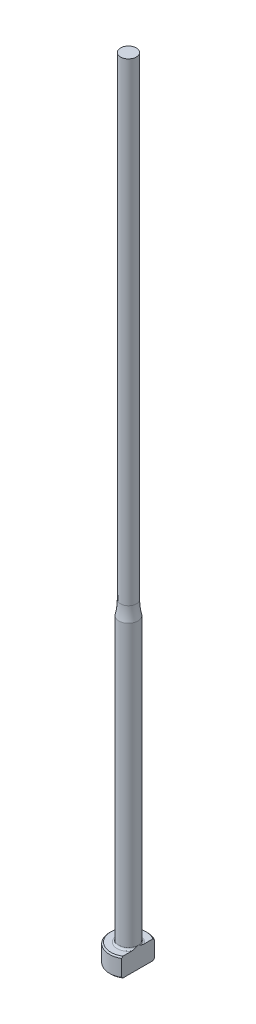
from build123d import *
from build123d.topology import SkipClean

# Parameters (mm, degrees)
CHAMFER1_SIZE = 0.2
FILLET1_R     = 0.3
KEY_DEPTH     = 126.071979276


with BuildPart() as part:
    # Sketch1 → Revolve1 (revolve)
    with BuildSketch(Plane.XY, mode=Mode.PRIVATE) as revolve1_sk:
        with BuildLine():
            Line((0, 0), (-3, 0))
            Line((-3, 0), (-3, 3))
            Line((-3, 3), (-1.5, 3))
            Line((-1.5, 3), (-1.5, 47.777951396))
            ThreePointArc((-1.5, 47.777951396), (-1.312696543, 48.881966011), (-1.25, 50))
            Line((-1.25, 50), (-1.25, 125))
            Line((-1.25, 125), (0, 125))
            Line((0, 125), (0, 0))
        make_face()
    revolve(revolve1_sk.sketch.rotate(Axis((0, 259.958771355, 0), (0, -1, 0)), 270), axis=Axis((0, 259.958771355, 0), (0, -1, 0)))

    # Chamfer1
    chamfer1_edges = [part.edges().sort_by_distance(p)[0] for p in [
        (0, 0, -3),
        (0, 3, -3),
    ]]
    chamfer(chamfer1_edges, length=CHAMFER1_SIZE)

    # Fillet1
    fillet1_edges = [part.edges().sort_by_distance(p)[0] for p in [
        (0, 3, -1.5),
    ]]
    fillet(fillet1_edges, radius=FILLET1_R)

    # Sketch2 → KEY (cut, through all)
    with SkipClean():  # the faces are left unmerged after this step: merging them gives an invalid solid
        with BuildSketch(Plane(origin=(0, 0, 0), x_dir=(1, 0, 0), z_dir=(0, 1, 0))):
            with BuildLine():
                Line((1.5, 2.598076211), (1.5, -2.598076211))
                ThreePointArc((1.5, -2.598076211), (3, 0), (1.5, 2.598076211))
            make_face()
        extrude(amount=KEY_DEPTH, mode=Mode.SUBTRACT)


solid = part.part
